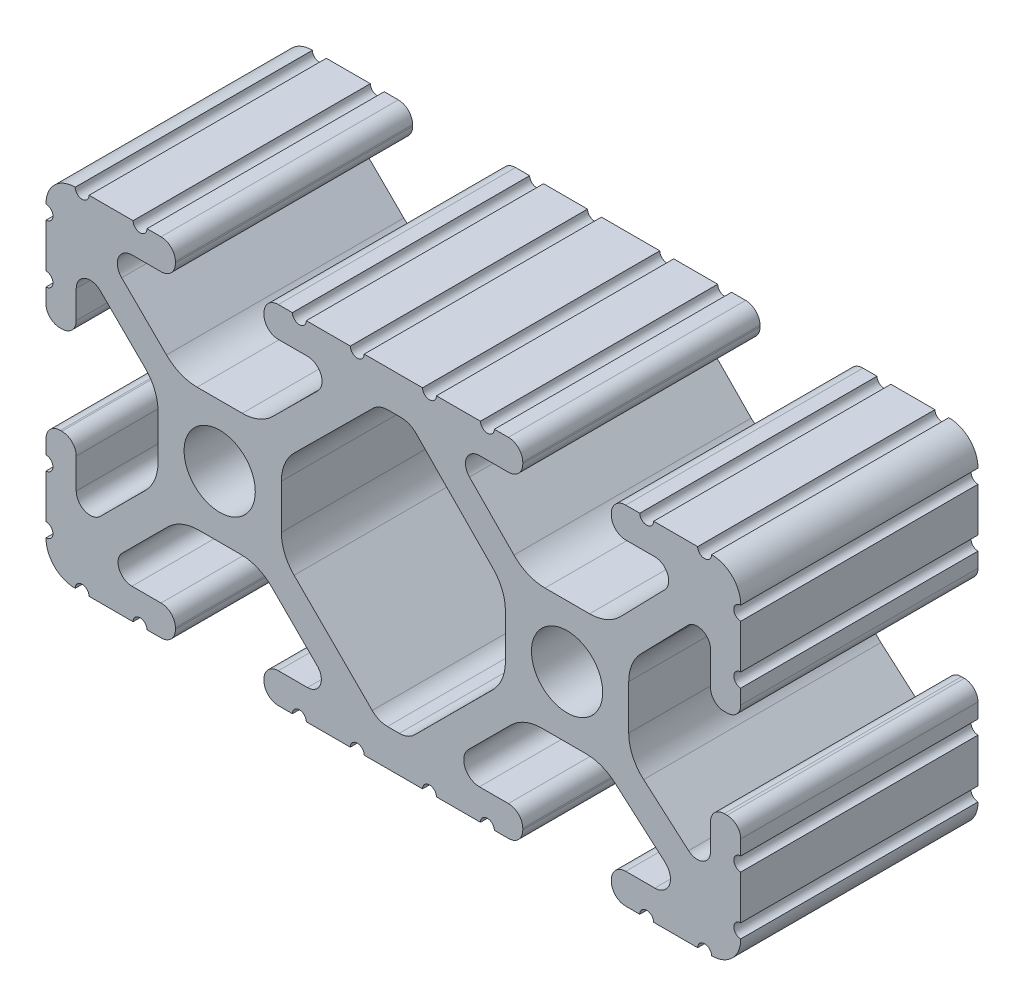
from build123d import *

# Parameters (mm, degrees)
SKETCH1_R           = 2.6035
BOSS_EXTRUDE1_DEPTH = 8.6741


with BuildPart() as part:
    # Sketch1 → Boss-Extrude1 (new, symmetric)
    with BuildSketch(Plane.XY):
        with BuildLine():
            Line((18.01710265, 12.7), (16.98745015, 12.7))
            ThreePointArc((16.98745015, 12.7), (16.245730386, 12.392769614), (15.9385, 11.65104985))
            Line((15.9385, 11.65104985), (15.9385, 11.53922))
            ThreePointArc((15.9385, 11.53922), (16.245750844, 10.797450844), (16.98752, 10.4902))
            Line((16.98752, 10.4902), (19.116384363, 10.4902))
            ThreePointArc((19.116384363, 10.4902), (20.052502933, 9.869096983), (19.844087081, 8.765172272))
            Line((19.844087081, 8.765172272), (16.618993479, 5.455112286))
            ThreePointArc((16.618993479, 5.455112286), (15.578994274, 4.745442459), (14.344932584, 4.4958))
            Line((14.344932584, 4.4958), (11.083317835, 4.4958))
            ThreePointArc((11.083317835, 4.4958), (9.854330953, 4.743306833), (8.816955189, 5.447238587))
            Line((8.816955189, 5.447238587), (5.564154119, 8.762652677))
            ThreePointArc((5.564154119, 8.762652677), (5.352591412, 9.867473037), (6.289393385, 10.4902))
            Line((6.289393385, 10.4902), (8.41248, 10.4902))
            ThreePointArc((8.41248, 10.4902), (9.154249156, 10.797450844), (9.4615, 11.53922))
            Line((9.4615, 11.53922), (9.4615, 11.65104985))
            ThreePointArc((9.4615, 11.65104985), (9.154269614, 12.392769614), (8.41254985, 12.7))
            Line((8.41254985, 12.7), (7.38288465, 12.7))
            ThreePointArc((7.38288465, 12.7), (6.87488465, 12.192), (6.36688465, 12.7))
            Line((6.36688465, 12.7), (3.14958095, 12.7))
            ThreePointArc((3.14958095, 12.7), (2.64158095, 12.192), (2.13358095, 12.7))
            Line((2.13358095, 12.7), (-2.13358095, 12.7))
            ThreePointArc((-2.13358095, 12.7), (-2.64158095, 12.192), (-3.14958095, 12.7))
            Line((-3.14958095, 12.7), (-6.36689735, 12.7))
            ThreePointArc((-6.36689735, 12.7), (-6.87489735, 12.192), (-7.38289735, 12.7))
            Line((-7.38289735, 12.7), (-8.41254985, 12.7))
            ThreePointArc((-8.41254985, 12.7), (-9.154269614, 12.392769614), (-9.4615, 11.65104985))
            Line((-9.4615, 11.65104985), (-9.4615, 11.53922))
            ThreePointArc((-9.4615, 11.53922), (-9.154249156, 10.797450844), (-8.41248, 10.4902))
            Line((-8.41248, 10.4902), (-6.283641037, 10.4902))
            ThreePointArc((-6.283641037, 10.4902), (-5.297291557, 9.829633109), (-5.532576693, 8.666071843))
            Line((-5.532576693, 8.666071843), (-8.809985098, 5.416263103))
            ThreePointArc((-8.809985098, 5.416263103), (-9.836720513, 4.734920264), (-11.045536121, 4.4958))
            Line((-11.045536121, 4.4958), (-14.354463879, 4.4958))
            ThreePointArc((-14.354463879, 4.4958), (-15.563279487, 4.734920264), (-16.590014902, 5.416263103))
            Line((-16.590014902, 5.416263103), (-19.867423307, 8.666071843))
            ThreePointArc((-19.867423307, 8.666071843), (-20.102708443, 9.829633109), (-19.116358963, 10.4902))
            Line((-19.116358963, 10.4902), (-16.98752, 10.4902))
            ThreePointArc((-16.98752, 10.4902), (-16.245750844, 10.797450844), (-15.9385, 11.53922))
            Line((-15.9385, 11.53922), (-15.9385, 11.65104985))
            ThreePointArc((-15.9385, 11.65104985), (-16.245730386, 12.392769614), (-16.98745015, 12.7))
            Line((-16.98745015, 12.7), (-18.01711535, 12.7))
            ThreePointArc((-18.01711535, 12.7), (-18.52511535, 12.192), (-19.03311535, 12.7))
            Line((-19.03311535, 12.7), (-22.2504, 12.7))
            ThreePointArc((-22.2504, 12.7), (-22.758323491, 12.192000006), (-23.266399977, 12.699846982))
            ThreePointArc((-23.266399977, 12.699846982), (-24.782522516, 12.082522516), (-25.399846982, 10.566399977))
            ThreePointArc((-25.399846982, 10.566399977), (-24.892000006, 10.058323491), (-25.4, 9.5504))
            Line((-25.4, 9.5504), (-25.4, 6.3330836))
            ThreePointArc((-25.4, 6.3330836), (-24.892, 5.8250836), (-25.4, 5.3170836))
            Line((-25.4, 5.3170836), (-25.4, 4.237520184))
            ThreePointArc((-25.4, 4.237520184), (-25.107393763, 3.531106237), (-24.400979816, 3.2385))
            Line((-24.400979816, 3.2385), (-24.23922, 3.2385))
            ThreePointArc((-24.23922, 3.2385), (-23.497450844, 3.545750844), (-23.1902, 4.28752))
            Line((-23.1902, 4.28752), (-23.1902, 6.334741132))
            ThreePointArc((-23.1902, 6.334741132), (-22.556026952, 7.286023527), (-21.434002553, 7.066535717))
            Line((-21.434002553, 7.066535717), (-18.147950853, 3.808156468))
            ThreePointArc((-18.147950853, 3.808156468), (-17.452759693, 2.774838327), (-17.208501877, 1.553619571))
            Line((-17.208501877, 1.553619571), (-17.208501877, -1.695179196))
            ThreePointArc((-17.208501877, -1.695179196), (-17.450738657, -2.911536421), (-18.140486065, -3.942289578))
            Line((-18.140486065, -3.942289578), (-21.431579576, -7.227386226))
            ThreePointArc((-21.431579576, -7.227386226), (-22.55444896, -7.449940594), (-23.1902, -6.498002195))
            Line((-23.1902, -6.498002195), (-23.1902, -4.28752))
            ThreePointArc((-23.1902, -4.28752), (-23.497450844, -3.545750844), (-24.23922, -3.2385))
            Line((-24.23922, -3.2385), (-24.35098, -3.2385))
            ThreePointArc((-24.35098, -3.2385), (-25.092749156, -3.545750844), (-25.4, -4.28752))
            Line((-25.4, -4.28752), (-25.4, -5.3171344))
            ThreePointArc((-25.4, -5.3171344), (-24.892, -5.8251344), (-25.4, -6.3331344))
            Line((-25.4, -6.3331344), (-25.4, -9.5504))
            ThreePointArc((-25.4, -9.5504), (-24.892000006, -10.058323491), (-25.399846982, -10.566399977))
            ThreePointArc((-25.399846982, -10.566399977), (-24.782522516, -12.082522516), (-23.266399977, -12.699846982))
            ThreePointArc((-23.266399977, -12.699846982), (-22.758323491, -12.192000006), (-22.2504, -12.7))
            Line((-22.2504, -12.7), (-19.03308995, -12.7))
            ThreePointArc((-19.03308995, -12.7), (-18.52508995, -12.192), (-18.01708995, -12.7))
            Line((-18.01708995, -12.7), (-16.9874692, -12.7))
            ThreePointArc((-16.9874692, -12.7), (-16.245700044, -12.392749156), (-15.9384492, -11.65098))
            Line((-15.9384492, -11.65098), (-15.9384492, -11.53922))
            ThreePointArc((-15.9384492, -11.53922), (-16.245700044, -10.797450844), (-16.9874692, -10.4902))
            Line((-16.9874692, -10.4902), (-19.116358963, -10.4902))
            ThreePointArc((-19.116358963, -10.4902), (-20.055197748, -9.862578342), (-19.834124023, -8.755124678))
            Line((-19.834124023, -8.755124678), (-16.49660751, -5.423689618))
            ThreePointArc((-16.49660751, -5.423689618), (-15.467274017, -4.736928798), (-14.253591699, -4.4958))
            Line((-14.253591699, -4.4958), (-11.146408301, -4.4958))
            ThreePointArc((-11.146408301, -4.4958), (-9.932725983, -4.736928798), (-8.90339249, -5.423689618))
            Line((-8.90339249, -5.423689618), (-5.565875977, -8.755124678))
            ThreePointArc((-5.565875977, -8.755124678), (-5.344802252, -9.862578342), (-6.283641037, -10.4902))
            Line((-6.283641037, -10.4902), (-8.4125308, -10.4902))
            ThreePointArc((-8.4125308, -10.4902), (-9.154299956, -10.797450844), (-9.4615508, -11.53922))
            Line((-9.4615508, -11.53922), (-9.4615508, -11.65098))
            ThreePointArc((-9.4615508, -11.65098), (-9.154299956, -12.392749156), (-8.4125308, -12.7))
            Line((-8.4125308, -12.7), (-7.38287195, -12.7))
            ThreePointArc((-7.38287195, -12.7), (-6.87487195, -12.192), (-6.36687195, -12.7))
            Line((-6.36687195, -12.7), (-3.14960635, -12.7))
            ThreePointArc((-3.14960635, -12.7), (-2.64160635, -12.192), (-2.13360635, -12.7))
            Line((-2.13360635, -12.7), (2.13360635, -12.7))
            ThreePointArc((2.13360635, -12.7), (2.64159365, -12.1920127), (3.14958095, -12.7))
            Line((3.14958095, -12.7), (6.36691005, -12.7))
            ThreePointArc((6.36691005, -12.7), (6.87491005, -12.192), (7.38291005, -12.7))
            Line((7.38291005, -12.7), (8.4125308, -12.7))
            ThreePointArc((8.4125308, -12.7), (9.154299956, -12.392749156), (9.4615508, -11.65098))
            Line((9.4615508, -11.65098), (9.4615508, -11.53922))
            ThreePointArc((9.4615508, -11.53922), (9.154299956, -10.797450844), (8.4125308, -10.4902))
            Line((8.4125308, -10.4902), (6.289393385, -10.4902))
            ThreePointArc((6.289393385, -10.4902), (5.231590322, -9.783049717), (5.480677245, -8.535265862))
            Line((5.480677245, -8.535265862), (8.597933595, -5.423689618))
            ThreePointArc((8.597933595, -5.423689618), (9.627267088, -4.736928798), (10.840949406, -4.4958))
            Line((10.840949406, -4.4958), (14.102564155, -4.4958))
            ThreePointArc((14.102564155, -4.4958), (15.215927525, -4.697410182), (16.187895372, -5.276636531))
            Line((16.187895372, -5.276636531), (19.868247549, -8.482246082))
            ThreePointArc((19.868247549, -8.482246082), (20.188435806, -9.746879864), (19.116384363, -10.4902))
            Line((19.116384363, -10.4902), (16.9874692, -10.4902))
            ThreePointArc((16.9874692, -10.4902), (16.245700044, -10.797450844), (15.9384492, -11.53922))
            Line((15.9384492, -11.53922), (15.9384492, -11.65098))
            ThreePointArc((15.9384492, -11.65098), (16.245700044, -12.392749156), (16.9874692, -12.7))
            Line((16.9874692, -12.7), (18.01710265, -12.7))
            ThreePointArc((18.01710265, -12.7), (18.52510265, -12.192), (19.03310265, -12.7))
            Line((19.03310265, -12.7), (22.2504, -12.7))
            ThreePointArc((22.2504, -12.7), (22.758323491, -12.192000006), (23.266399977, -12.699846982))
            ThreePointArc((23.266399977, -12.699846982), (24.782522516, -12.082522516), (25.399846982, -10.566399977))
            ThreePointArc((25.399846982, -10.566399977), (24.892000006, -10.058323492), (25.4, -9.550400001))
            Line((25.4, -9.550400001), (25.4, -6.333083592))
            ThreePointArc((25.4, -6.333083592), (24.892000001, -5.825083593), (25.4, -5.317083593))
            Line((25.4, -5.317083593), (25.4, -4.237520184))
            ThreePointArc((25.4, -4.237520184), (25.107393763, -3.531106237), (24.400979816, -3.2385))
            Line((24.400979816, -3.2385), (24.189220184, -3.2385))
            ThreePointArc((24.189220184, -3.2385), (23.482806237, -3.531106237), (23.1902, -4.237520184))
            Line((23.1902, -4.237520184), (23.1902, -6.155876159))
            ThreePointArc((23.1902, -6.155876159), (22.62232736, -7.038258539), (21.583974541, -6.886926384))
            Line((21.583974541, -6.886926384), (18.29817066, -4.024970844))
            ThreePointArc((18.29817066, -4.024970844), (17.493730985, -2.946044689), (17.208501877, -1.630807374))
            Line((17.208501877, -1.630807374), (17.208501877, 1.630807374))
            ThreePointArc((17.208501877, 1.630807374), (17.442348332, 2.82673414), (18.109440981, 3.846495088))
            Line((18.109440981, 3.846495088), (21.526346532, 7.353420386))
            ThreePointArc((21.526346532, 7.353420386), (22.585896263, 7.574939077), (23.1902, 6.676867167))
            Line((23.1902, 6.676867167), (23.1902, 4.237520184))
            ThreePointArc((23.1902, 4.237520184), (23.482806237, 3.531106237), (24.189220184, 3.2385))
            Line((24.189220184, 3.2385), (24.400979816, 3.2385))
            ThreePointArc((24.400979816, 3.2385), (25.107393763, 3.531106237), (25.4, 4.237520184))
            Line((25.4, 4.237520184), (25.4, 5.3170836))
            ThreePointArc((25.4, 5.3170836), (24.891949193, 5.825134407), (25.4, 6.333185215))
            Line((25.4, 6.333185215), (25.4, 9.550400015))
            ThreePointArc((25.4, 9.550400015), (24.892000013, 10.058323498), (25.399846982, 10.566399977))
            ThreePointArc((25.399846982, 10.566399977), (24.782522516, 12.082522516), (23.266399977, 12.699846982))
            ThreePointArc((23.266399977, 12.699846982), (22.758323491, 12.192000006), (22.2504, 12.7))
            Line((22.2504, 12.7), (19.03310265, 12.7))
            ThreePointArc((19.03310265, 12.7), (18.52510265, 12.192), (18.01710265, 12.7))
        make_face()
        with Locations((-12.7, 0)):
            Circle(SKETCH1_R, mode=Mode.SUBTRACT)
        with Locations((12.7, 0)):
            Circle(SKETCH1_R, mode=Mode.SUBTRACT)
        with BuildLine():
            Line((-7.259513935, -3.869413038), (-1.545748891, -9.572766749))
            ThreePointArc((-1.545748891, -9.572766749), (-1.035199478, -9.913400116), (-0.433213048, -10.033))
            Line((-0.433213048, -10.033), (0.433213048, -10.033))
            ThreePointArc((0.433213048, -10.033), (1.035199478, -9.913400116), (1.545748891, -9.572766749))
            Line((1.545748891, -9.572766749), (7.259513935, -3.869413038))
            ThreePointArc((7.259513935, -3.869413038), (7.949261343, -2.838659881), (8.191498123, -1.622302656))
            Line((8.191498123, -1.622302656), (8.191498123, 1.622302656))
            ThreePointArc((8.191498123, 1.622302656), (7.955573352, 2.823327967), (7.282860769, 3.845864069))
            Line((7.282860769, 3.845864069), (1.675572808, 9.561086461))
            ThreePointArc((1.675572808, 9.561086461), (1.161034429, 9.910236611), (0.551456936, 10.033))
            Line((0.551456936, 10.033), (-0.395199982, 10.033))
            ThreePointArc((-0.395199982, 10.033), (-0.994772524, 9.914396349), (-1.50403329, 9.576450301))
            Line((-1.50403329, 9.576450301), (-7.252049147, 3.876839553))
            ThreePointArc((-7.252049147, 3.876839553), (-7.947240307, 2.843521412), (-8.191498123, 1.622302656))
            Line((-8.191498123, 1.622302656), (-8.191498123, -1.622302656))
            ThreePointArc((-8.191498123, -1.622302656), (-7.949261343, -2.838659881), (-7.259513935, -3.869413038))
        make_face(mode=Mode.SUBTRACT)
    extrude(amount=BOSS_EXTRUDE1_DEPTH, both=True)


solid = part.part
